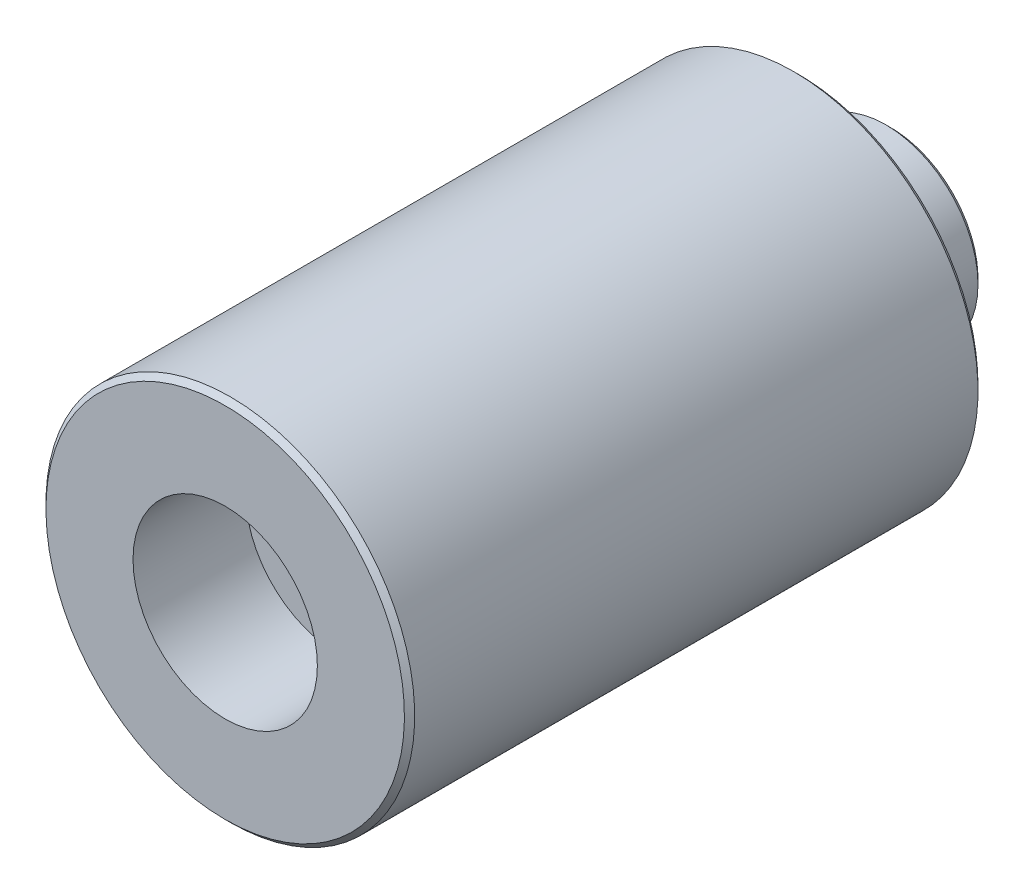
ISO-10303-21;
HEADER;
FILE_DESCRIPTION(('STEP AP214'),'2;1');
FILE_NAME('part.step','',(''),(''),'','','');
FILE_SCHEMA(('AUTOMOTIVE_DESIGN { 1 0 10303 214 1 1 1 1 }'));
ENDSEC;
DATA;
#1=APPLICATION_CONTEXT('core data for automotive mechanical design processes');
#2=APPLICATION_PROTOCOL_DEFINITION('international standard','automotive_design',2000,#1);
#3=PRODUCT_CONTEXT('',#1,'mechanical');
#4=PRODUCT('Part','Part','',(#3));
#5=PRODUCT_RELATED_PRODUCT_CATEGORY('part','',(#4));
#6=PRODUCT_DEFINITION_FORMATION('','',#4);
#7=PRODUCT_DEFINITION_CONTEXT('part definition',#1,'design');
#8=PRODUCT_DEFINITION('design','',#6,#7);
#9=PRODUCT_DEFINITION_SHAPE('','',#8);
#10=(LENGTH_UNIT() NAMED_UNIT(*) SI_UNIT(.MILLI.,.METRE.));
#11=(NAMED_UNIT(*) PLANE_ANGLE_UNIT() SI_UNIT($,.RADIAN.));
#12=(NAMED_UNIT(*) SI_UNIT($,.STERADIAN.) SOLID_ANGLE_UNIT());
#13=UNCERTAINTY_MEASURE_WITH_UNIT(LENGTH_MEASURE(1.E-05),#10,'distance_accuracy_value','');
#14=(GEOMETRIC_REPRESENTATION_CONTEXT(3) GLOBAL_UNCERTAINTY_ASSIGNED_CONTEXT((#13)) GLOBAL_UNIT_ASSIGNED_CONTEXT((#10,
#11,#12)) REPRESENTATION_CONTEXT('',''));
#15=CARTESIAN_POINT('',(0.,0.,0.));
#16=DIRECTION('',(0.,0.,1.));
#17=DIRECTION('',(1.,0.,0.));
#18=AXIS2_PLACEMENT_3D('',#15,#16,#17);
#19=CARTESIAN_POINT('',(0.,0.,0.));
#20=DIRECTION('',(0.,0.,1.));
#21=DIRECTION('',(0.,-1.,0.));
#22=AXIS2_PLACEMENT_3D('',#19,#20,#21);
#23=CYLINDRICAL_SURFACE('',#22,9.);
#24=CARTESIAN_POINT('',(0.,0.,-11.));
#25=DIRECTION('',(0.,0.,1.));
#26=DIRECTION('',(0.,-1.,0.));
#27=AXIS2_PLACEMENT_3D('',#24,#25,#26);
#28=CIRCLE('',#27,9.);
#29=CARTESIAN_POINT('',(0.,-9.,-11.));
#30=VERTEX_POINT('',#29);
#31=EDGE_CURVE('E71',#30,#30,#28,.T.);
#32=ORIENTED_EDGE('',*,*,#31,.F.);
#33=EDGE_LOOP('',(#32));
#34=FACE_BOUND('',#33,.T.);
#35=CARTESIAN_POINT('',(0.,0.,0.));
#36=DIRECTION('',(0.,0.,1.));
#37=DIRECTION('',(0.,-1.,0.));
#38=AXIS2_PLACEMENT_3D('',#35,#36,#37);
#39=CIRCLE('',#38,9.);
#40=CARTESIAN_POINT('',(0.,-9.,0.));
#41=VERTEX_POINT('',#40);
#42=EDGE_CURVE('E10',#41,#41,#39,.T.);
#43=ORIENTED_EDGE('',*,*,#42,.T.);
#44=EDGE_LOOP('',(#43));
#45=FACE_BOUND('',#44,.T.);
#46=ADVANCED_FACE('F34',(#34,#45),#23,.F.);
#47=CARTESIAN_POINT('',(0.,9.,0.));
#48=DIRECTION('',(0.,0.,-1.));
#49=DIRECTION('',(0.,1.,0.));
#50=AXIS2_PLACEMENT_3D('',#47,#48,#49);
#51=PLANE('',#50);
#52=ORIENTED_EDGE('',*,*,#42,.F.);
#53=EDGE_LOOP('',(#52));
#54=FACE_BOUND('',#53,.T.);
#55=CARTESIAN_POINT('',(0.,0.,0.));
#56=DIRECTION('',(0.,0.,1.));
#57=DIRECTION('',(0.,-1.,0.));
#58=AXIS2_PLACEMENT_3D('',#55,#56,#57);
#59=CIRCLE('',#58,17.5);
#60=CARTESIAN_POINT('',(0.,-17.5,0.));
#61=VERTEX_POINT('',#60);
#62=EDGE_CURVE('E40',#61,#61,#59,.T.);
#63=ORIENTED_EDGE('',*,*,#62,.T.);
#64=EDGE_LOOP('',(#63));
#65=FACE_BOUND('',#64,.T.);
#66=ADVANCED_FACE('F78',(#54,#65),#51,.F.);
#67=CARTESIAN_POINT('',(0.,0.,-0.500000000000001));
#68=DIRECTION('',(0.,0.,-1.));
#69=DIRECTION('',(0.,1.,0.));
#70=AXIS2_PLACEMENT_3D('',#67,#68,#69);
#71=CONICAL_SURFACE('',#70,18.,0.785398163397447);
#72=ORIENTED_EDGE('',*,*,#62,.F.);
#73=EDGE_LOOP('',(#72));
#74=FACE_BOUND('',#73,.T.);
#75=CARTESIAN_POINT('',(0.,0.,-0.500000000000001));
#76=DIRECTION('',(0.,0.,1.));
#77=DIRECTION('',(0.,-1.,0.));
#78=AXIS2_PLACEMENT_3D('',#75,#76,#77);
#79=CIRCLE('',#78,18.);
#80=CARTESIAN_POINT('',(0.,-18.,-0.500000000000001));
#81=VERTEX_POINT('',#80);
#82=EDGE_CURVE('E44',#81,#81,#79,.T.);
#83=ORIENTED_EDGE('',*,*,#82,.T.);
#84=EDGE_LOOP('',(#83));
#85=FACE_BOUND('',#84,.T.);
#86=ADVANCED_FACE('F82',(#74,#85),#71,.T.);
#87=CARTESIAN_POINT('',(0.,0.,0.));
#88=DIRECTION('',(0.,0.,1.));
#89=DIRECTION('',(0.,-1.,0.));
#90=AXIS2_PLACEMENT_3D('',#87,#88,#89);
#91=CYLINDRICAL_SURFACE('',#90,18.);
#92=ORIENTED_EDGE('',*,*,#82,.F.);
#93=EDGE_LOOP('',(#92));
#94=FACE_BOUND('',#93,.T.);
#95=CARTESIAN_POINT('',(0.,0.,-55.5));
#96=DIRECTION('',(0.,0.,1.));
#97=DIRECTION('',(0.,-1.,0.));
#98=AXIS2_PLACEMENT_3D('',#95,#96,#97);
#99=CIRCLE('',#98,18.);
#100=CARTESIAN_POINT('',(0.,-18.,-55.5));
#101=VERTEX_POINT('',#100);
#102=EDGE_CURVE('E48',#101,#101,#99,.T.);
#103=ORIENTED_EDGE('',*,*,#102,.T.);
#104=EDGE_LOOP('',(#103));
#105=FACE_BOUND('',#104,.T.);
#106=ADVANCED_FACE('F87',(#94,#105),#91,.T.);
#107=CARTESIAN_POINT('',(0.,0.,-56.));
#108=DIRECTION('',(0.,0.,1.));
#109=DIRECTION('',(0.,-1.,0.));
#110=AXIS2_PLACEMENT_3D('',#107,#108,#109);
#111=CONICAL_SURFACE('',#110,17.5,0.785398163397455);
#112=ORIENTED_EDGE('',*,*,#102,.F.);
#113=EDGE_LOOP('',(#112));
#114=FACE_BOUND('',#113,.T.);
#115=CARTESIAN_POINT('',(0.,0.,-56.));
#116=DIRECTION('',(0.,0.,1.));
#117=DIRECTION('',(0.,-1.,0.));
#118=AXIS2_PLACEMENT_3D('',#115,#116,#117);
#119=CIRCLE('',#118,17.5);
#120=CARTESIAN_POINT('',(0.,-17.5,-56.));
#121=VERTEX_POINT('',#120);
#122=EDGE_CURVE('E53',#121,#121,#119,.T.);
#123=ORIENTED_EDGE('',*,*,#122,.T.);
#124=EDGE_LOOP('',(#123));
#125=FACE_BOUND('',#124,.T.);
#126=ADVANCED_FACE('F93',(#114,#125),#111,.T.);
#127=CARTESIAN_POINT('',(0.,9.,-56.));
#128=DIRECTION('',(0.,0.,1.));
#129=DIRECTION('',(0.,-1.,0.));
#130=AXIS2_PLACEMENT_3D('',#127,#128,#129);
#131=PLANE('',#130);
#132=ORIENTED_EDGE('',*,*,#122,.F.);
#133=EDGE_LOOP('',(#132));
#134=FACE_BOUND('',#133,.T.);
#135=CARTESIAN_POINT('',(0.,0.,-56.));
#136=DIRECTION('',(0.,0.,1.));
#137=DIRECTION('',(0.,-1.,0.));
#138=AXIS2_PLACEMENT_3D('',#135,#136,#137);
#139=CIRCLE('',#138,9.);
#140=CARTESIAN_POINT('',(0.,-9.,-56.));
#141=VERTEX_POINT('',#140);
#142=EDGE_CURVE('E56',#141,#141,#139,.T.);
#143=ORIENTED_EDGE('',*,*,#142,.T.);
#144=EDGE_LOOP('',(#143));
#145=FACE_BOUND('',#144,.T.);
#146=ADVANCED_FACE('F97',(#134,#145),#131,.F.);
#147=CARTESIAN_POINT('',(0.,0.,0.));
#148=DIRECTION('',(0.,0.,1.));
#149=DIRECTION('',(0.,-1.,0.));
#150=AXIS2_PLACEMENT_3D('',#147,#148,#149);
#151=CYLINDRICAL_SURFACE('',#150,9.);
#152=ORIENTED_EDGE('',*,*,#142,.F.);
#153=EDGE_LOOP('',(#152));
#154=FACE_BOUND('',#153,.T.);
#155=CARTESIAN_POINT('',(0.,0.,-64.5));
#156=DIRECTION('',(0.,0.,1.));
#157=DIRECTION('',(0.,-1.,0.));
#158=AXIS2_PLACEMENT_3D('',#155,#156,#157);
#159=CIRCLE('',#158,9.);
#160=CARTESIAN_POINT('',(0.,-9.,-64.5));
#161=VERTEX_POINT('',#160);
#162=EDGE_CURVE('E59',#161,#161,#159,.T.);
#163=ORIENTED_EDGE('',*,*,#162,.T.);
#164=EDGE_LOOP('',(#163));
#165=FACE_BOUND('',#164,.T.);
#166=ADVANCED_FACE('F101',(#154,#165),#151,.T.);
#167=CARTESIAN_POINT('',(0.,0.,-65.));
#168=DIRECTION('',(0.,0.,1.));
#169=DIRECTION('',(0.,-1.,0.));
#170=AXIS2_PLACEMENT_3D('',#167,#168,#169);
#171=CONICAL_SURFACE('',#170,8.5,0.78539816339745);
#172=ORIENTED_EDGE('',*,*,#162,.F.);
#173=EDGE_LOOP('',(#172));
#174=FACE_BOUND('',#173,.T.);
#175=CARTESIAN_POINT('',(0.,0.,-65.));
#176=DIRECTION('',(0.,0.,1.));
#177=DIRECTION('',(0.,-1.,0.));
#178=AXIS2_PLACEMENT_3D('',#175,#176,#177);
#179=CIRCLE('',#178,8.5);
#180=CARTESIAN_POINT('',(0.,-8.5,-65.));
#181=VERTEX_POINT('',#180);
#182=EDGE_CURVE('E62',#181,#181,#179,.T.);
#183=ORIENTED_EDGE('',*,*,#182,.T.);
#184=EDGE_LOOP('',(#183));
#185=FACE_BOUND('',#184,.T.);
#186=ADVANCED_FACE('F105',(#174,#185),#171,.T.);
#187=CARTESIAN_POINT('',(0.,8.5,-65.));
#188=DIRECTION('',(0.,0.,1.));
#189=DIRECTION('',(0.,-1.,0.));
#190=AXIS2_PLACEMENT_3D('',#187,#188,#189);
#191=PLANE('',#190);
#192=ORIENTED_EDGE('',*,*,#182,.F.);
#193=EDGE_LOOP('',(#192));
#194=FACE_BOUND('',#193,.T.);
#195=CARTESIAN_POINT('',(0.,0.,-65.));
#196=DIRECTION('',(0.,0.,1.));
#197=DIRECTION('',(0.,-1.,0.));
#198=AXIS2_PLACEMENT_3D('',#195,#196,#197);
#199=CIRCLE('',#198,5.5);
#200=CARTESIAN_POINT('',(0.,-5.5,-65.));
#201=VERTEX_POINT('',#200);
#202=EDGE_CURVE('E65',#201,#201,#199,.T.);
#203=ORIENTED_EDGE('',*,*,#202,.T.);
#204=EDGE_LOOP('',(#203));
#205=FACE_BOUND('',#204,.T.);
#206=ADVANCED_FACE('F109',(#194,#205),#191,.F.);
#207=CARTESIAN_POINT('',(0.,0.,0.));
#208=DIRECTION('',(0.,0.,1.));
#209=DIRECTION('',(0.,-1.,0.));
#210=AXIS2_PLACEMENT_3D('',#207,#208,#209);
#211=CYLINDRICAL_SURFACE('',#210,5.5);
#212=ORIENTED_EDGE('',*,*,#202,.F.);
#213=EDGE_LOOP('',(#212));
#214=FACE_BOUND('',#213,.T.);
#215=CARTESIAN_POINT('',(0.,0.,-11.));
#216=DIRECTION('',(0.,0.,1.));
#217=DIRECTION('',(0.,-1.,0.));
#218=AXIS2_PLACEMENT_3D('',#215,#216,#217);
#219=CIRCLE('',#218,5.5);
#220=CARTESIAN_POINT('',(0.,-5.5,-11.));
#221=VERTEX_POINT('',#220);
#222=EDGE_CURVE('E68',#221,#221,#219,.T.);
#223=ORIENTED_EDGE('',*,*,#222,.T.);
#224=EDGE_LOOP('',(#223));
#225=FACE_BOUND('',#224,.T.);
#226=ADVANCED_FACE('F113',(#214,#225),#211,.F.);
#227=CARTESIAN_POINT('',(0.,9.,-11.));
#228=DIRECTION('',(0.,0.,-1.));
#229=DIRECTION('',(0.,1.,0.));
#230=AXIS2_PLACEMENT_3D('',#227,#228,#229);
#231=PLANE('',#230);
#232=ORIENTED_EDGE('',*,*,#222,.F.);
#233=EDGE_LOOP('',(#232));
#234=FACE_BOUND('',#233,.T.);
#235=ORIENTED_EDGE('',*,*,#31,.T.);
#236=EDGE_LOOP('',(#235));
#237=FACE_BOUND('',#236,.T.);
#238=ADVANCED_FACE('F75',(#234,#237),#231,.F.);
#239=CLOSED_SHELL('',(#46,#66,#86,#106,#126,#146,#166,#186,#206,#226,#238));
#240=MANIFOLD_SOLID_BREP('B2',#239);
#241=ADVANCED_BREP_SHAPE_REPRESENTATION('',(#18,#240),#14);
#242=SHAPE_DEFINITION_REPRESENTATION(#9,#241);
ENDSEC;
END-ISO-10303-21;
